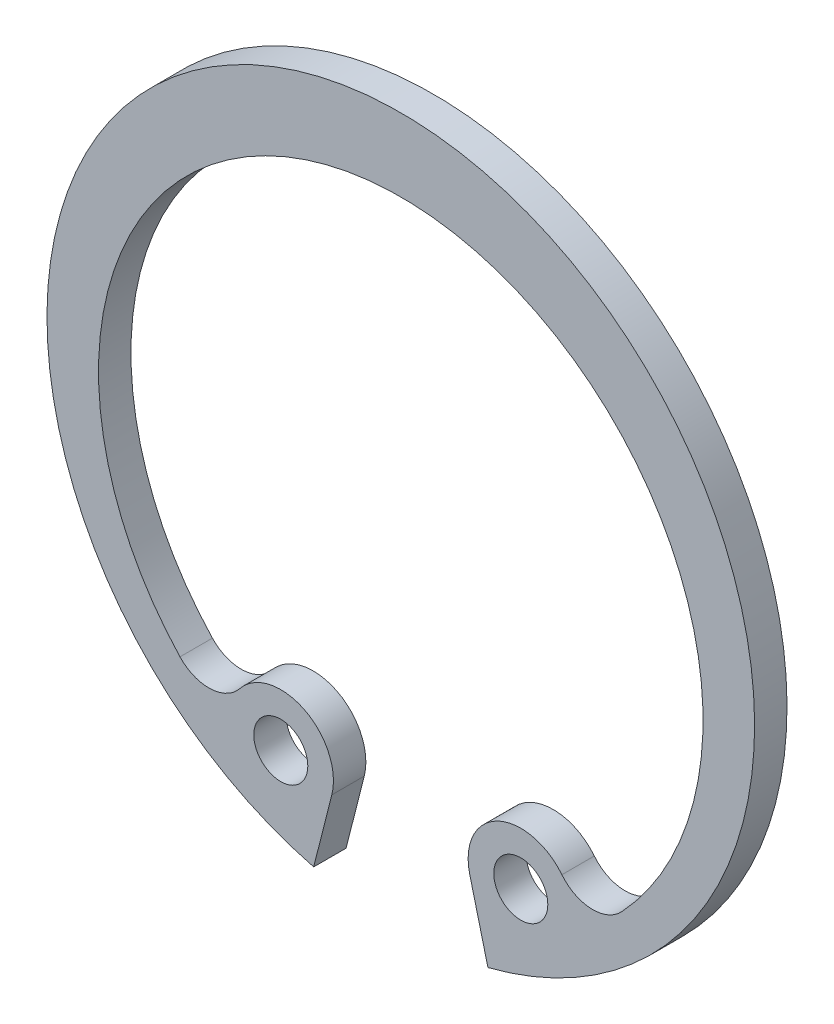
from build123d import *

# Parameters (mm, degrees)
BODYSKE_R  = 1
BODY_DEPTH = 1.2


with BuildPart() as part:
    # BodySke → Body (new body)
    with BuildSketch(Plane.XY):
        with BuildLine():
            Line((3.225876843, -12.69660264), (2.5531758, -10.048944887))
            ThreePointArc((2.5531758, -10.048944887), (3.573843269, -7.823236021), (5.965144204, -8.349754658))
            ThreePointArc((5.965144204, -8.349754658), (7.050742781, -8.8969336), (8.174976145, -8.434301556))
            ThreePointArc((8.174976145, -8.434301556), (0, 10.4), (-8.174976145, -8.434301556))
            ThreePointArc((-8.174976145, -8.434301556), (-7.050742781, -8.8969336), (-5.965144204, -8.349754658))
            ThreePointArc((-5.965144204, -8.349754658), (-3.573843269, -7.823236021), (-2.5531758, -10.048944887))
            Line((-2.5531758, -10.048944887), (-3.225876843, -12.69660264))
            ThreePointArc((-3.225876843, -12.69660264), (0, 13.1), (3.225876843, -12.69660264))
        make_face()
        with Locations((4.443128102, -9.568757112)):
            Circle(BODYSKE_R, mode=Mode.SUBTRACT)
        with Locations((-4.443128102, -9.568757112)):
            Circle(BODYSKE_R, mode=Mode.SUBTRACT)
    extrude(amount=-BODY_DEPTH)


solid = part.part
